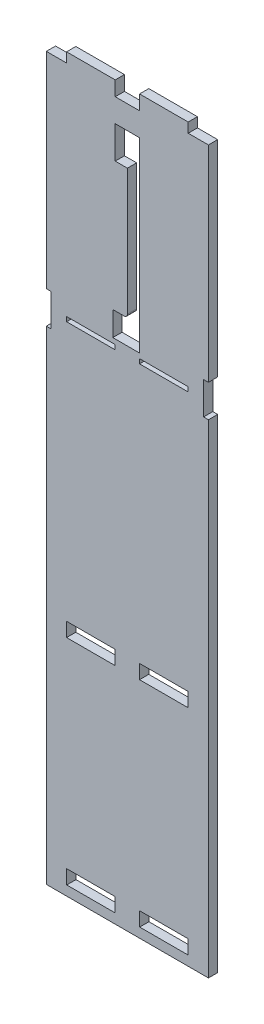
from build123d import *

# Parameters (mm, degrees)
CROQUIS1_W              = 100
CROQUIS1_H              = 445
SALIENTE_EXTRUIR1_DEPTH = 5.7
CROQUIS2_W              = 30
CROQUIS2_H              = 5.7
SALIENTE_EXTRUIR2_DEPTH = 6
CORTAR_EXTRUIR1_REACH   = 235.976
CROQUIS4_W              = 15
CROQUIS4_H              = 3
CROQUIS4_W_2            = 29.8
CROQUIS4_H_2            = 8.7
CROQUIS4_W_3            = 30
CROQUIS4_H_3            = 2.8
CROQUIS4_W_4            = 6
CROQUIS4_H_4            = 20
REDONDEO3_R             = 2


with BuildPart() as part:
    # Croquis1 → Saliente-Extruir1 (new body)
    with BuildSketch(Plane.XY):
        Rectangle(CROQUIS1_W, CROQUIS1_H)
    extrude(amount=SALIENTE_EXTRUIR1_DEPTH)

    # Croquis2 → Saliente-Extruir2 (add)
    with BuildSketch(Plane(origin=(0, 222.5, 0), x_dir=(1, 0, 0), z_dir=(0, 1, 0))):
        with Locations((-22.5, -2.85)):
            Rectangle(CROQUIS2_W, CROQUIS2_H)
        with Locations((22.5, -2.85)):
            Rectangle(CROQUIS2_W, CROQUIS2_H)
    extrude(amount=SALIENTE_EXTRUIR2_DEPTH)

    # Croquis4 → Cortar-Extruir1 (cut, up to next)
    with BuildSketch(Plane.XY.offset(5.7), mode=Mode.PRIVATE) as cortar_extruir1_sk1:
        with Locations((0, 221)):
            Rectangle(CROQUIS4_W, CROQUIS4_H)
    cortar_extruir1_tool1 = extrude(cortar_extruir1_sk1.sketch, amount=-CORTAR_EXTRUIR1_REACH, mode=Mode.PRIVATE) & part.part
    # Croquis4 → Cortar-Extruir1 (cut, up to next)
    with BuildSketch(Plane.XY.offset(5.7), mode=Mode.PRIVATE) as cortar_extruir1_sk2:
        with Locations((-22.5, -212.15)):
            Rectangle(CROQUIS4_W_2, CROQUIS4_H_2)
    cortar_extruir1_tool2 = extrude(cortar_extruir1_sk2.sketch, amount=-CORTAR_EXTRUIR1_REACH, mode=Mode.PRIVATE) & part.part
    # Croquis4 → Cortar-Extruir1 (cut, up to next)
    with BuildSketch(Plane.XY.offset(5.7), mode=Mode.PRIVATE) as cortar_extruir1_sk3:
        Polygon((0, 105.1), (-9, 105.1), (-9, 90.1), (0, 90.1), (7.5, 90.1), (7.5, 205.1), (-7.5, 205.1), (-7.5, 185.1), (0, 185.1), align=None)
    cortar_extruir1_tool3 = extrude(cortar_extruir1_sk3.sketch, amount=-CORTAR_EXTRUIR1_REACH, mode=Mode.PRIVATE) & part.part
    # Croquis4 → Cortar-Extruir1 (cut, up to next)
    with BuildSketch(Plane.XY.offset(5.7), mode=Mode.PRIVATE) as cortar_extruir1_sk4:
        with Locations((-22.5, 85.7)):
            Rectangle(CROQUIS4_W_3, CROQUIS4_H_3)
    cortar_extruir1_tool4 = extrude(cortar_extruir1_sk4.sketch, amount=-CORTAR_EXTRUIR1_REACH, mode=Mode.PRIVATE) & part.part
    # Croquis4 → Cortar-Extruir1 (cut, up to next)
    with BuildSketch(Plane.XY.offset(5.7), mode=Mode.PRIVATE) as cortar_extruir1_sk5:
        with Locations((22.5, -80.05)):
            Rectangle(CROQUIS4_W_3, CROQUIS4_H_2)
    cortar_extruir1_tool5 = extrude(cortar_extruir1_sk5.sketch, amount=-CORTAR_EXTRUIR1_REACH, mode=Mode.PRIVATE) & part.part
    # Croquis4 → Cortar-Extruir1 (cut, up to next)
    with BuildSketch(Plane.XY.offset(5.7), mode=Mode.PRIVATE) as cortar_extruir1_sk6:
        with Locations((22.5, 85.7)):
            Rectangle(CROQUIS4_W_3, CROQUIS4_H_3)
    cortar_extruir1_tool6 = extrude(cortar_extruir1_sk6.sketch, amount=-CORTAR_EXTRUIR1_REACH, mode=Mode.PRIVATE) & part.part
    # Croquis4 → Cortar-Extruir1 (cut, up to next)
    with BuildSketch(Plane.XY.offset(5.7), mode=Mode.PRIVATE) as cortar_extruir1_sk7:
        with Locations((-22.5, -80.05)):
            Rectangle(CROQUIS4_W_3, CROQUIS4_H_2)
    cortar_extruir1_tool7 = extrude(cortar_extruir1_sk7.sketch, amount=-CORTAR_EXTRUIR1_REACH, mode=Mode.PRIVATE) & part.part
    # Croquis4 → Cortar-Extruir1 (cut, up to next)
    with BuildSketch(Plane.XY.offset(5.7), mode=Mode.PRIVATE) as cortar_extruir1_sk8:
        with Locations((22.5, -212.15)):
            Rectangle(CROQUIS4_W_2, CROQUIS4_H_2)
    cortar_extruir1_tool8 = extrude(cortar_extruir1_sk8.sketch, amount=-CORTAR_EXTRUIR1_REACH, mode=Mode.PRIVATE) & part.part
    # Croquis4 → Cortar-Extruir1 (cut, up to next)
    with BuildSketch(Plane.XY.offset(5.7), mode=Mode.PRIVATE) as cortar_extruir1_sk9:
        with Locations((-50, 85.7)):
            Rectangle(CROQUIS4_W_4, CROQUIS4_H_4)
    cortar_extruir1_tool9 = extrude(cortar_extruir1_sk9.sketch, amount=-CORTAR_EXTRUIR1_REACH, mode=Mode.PRIVATE) & part.part
    # Croquis4 → Cortar-Extruir1 (cut, up to next)
    with BuildSketch(Plane.XY.offset(5.7), mode=Mode.PRIVATE) as cortar_extruir1_sk10:
        with Locations((50, 85.7)):
            Rectangle(CROQUIS4_W_4, CROQUIS4_H_4)
    cortar_extruir1_tool10 = extrude(cortar_extruir1_sk10.sketch, amount=-CORTAR_EXTRUIR1_REACH, mode=Mode.PRIVATE) & part.part
    add(cortar_extruir1_tool1.solids().sort_by_distance((0, 221, 5.7))[0], mode=Mode.SUBTRACT)
    add(cortar_extruir1_tool2.solids().sort_by_distance((-22.5, -212.15, 5.7))[0], mode=Mode.SUBTRACT)
    add(cortar_extruir1_tool3.solids().sort_by_distance((1.79902, 147.926797, 5.7))[0], mode=Mode.SUBTRACT)
    add(cortar_extruir1_tool4.solids().sort_by_distance((-22.5, 85.7, 5.7))[0], mode=Mode.SUBTRACT)
    add(cortar_extruir1_tool5.solids().sort_by_distance((22.5, -80.05, 5.7))[0], mode=Mode.SUBTRACT)
    add(cortar_extruir1_tool6.solids().sort_by_distance((22.5, 85.7, 5.7))[0], mode=Mode.SUBTRACT)
    add(cortar_extruir1_tool7.solids().sort_by_distance((-22.5, -80.05, 5.7))[0], mode=Mode.SUBTRACT)
    add(cortar_extruir1_tool8.solids().sort_by_distance((22.5, -212.15, 5.7))[0], mode=Mode.SUBTRACT)
    add(cortar_extruir1_tool9.solids().sort_by_distance((-50, 85.7, 5.7))[0], mode=Mode.SUBTRACT)
    add(cortar_extruir1_tool10.solids().sort_by_distance((50, 85.7, 5.7))[0], mode=Mode.SUBTRACT)

    # Redondeo3
    redondeo3_edges = [part.edges().sort_by_distance(p)[0] for p in [
        (0, 105.1, 2.85),
    ]]
    fillet(redondeo3_edges, radius=REDONDEO3_R)


solid = part.part
